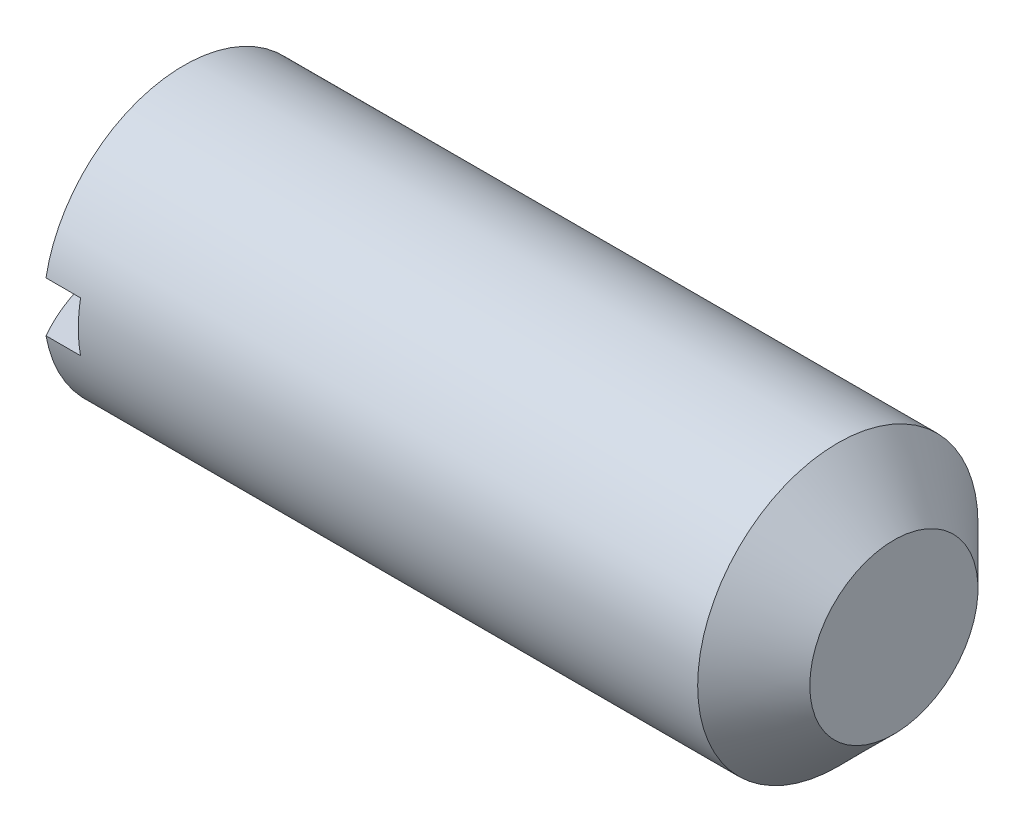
ISO-10303-21;
HEADER;
FILE_DESCRIPTION(('STEP AP214'),'2;1');
FILE_NAME('part.step','',(''),(''),'','','');
FILE_SCHEMA(('AUTOMOTIVE_DESIGN { 1 0 10303 214 1 1 1 1 }'));
ENDSEC;
DATA;
#1=APPLICATION_CONTEXT('core data for automotive mechanical design processes');
#2=APPLICATION_PROTOCOL_DEFINITION('international standard','automotive_design',2000,#1);
#3=PRODUCT_CONTEXT('',#1,'mechanical');
#4=PRODUCT('Part','Part','',(#3));
#5=PRODUCT_RELATED_PRODUCT_CATEGORY('part','',(#4));
#6=PRODUCT_DEFINITION_FORMATION('','',#4);
#7=PRODUCT_DEFINITION_CONTEXT('part definition',#1,'design');
#8=PRODUCT_DEFINITION('design','',#6,#7);
#9=PRODUCT_DEFINITION_SHAPE('','',#8);
#10=(LENGTH_UNIT() NAMED_UNIT(*) SI_UNIT(.MILLI.,.METRE.));
#11=(NAMED_UNIT(*) PLANE_ANGLE_UNIT() SI_UNIT($,.RADIAN.));
#12=(NAMED_UNIT(*) SI_UNIT($,.STERADIAN.) SOLID_ANGLE_UNIT());
#13=UNCERTAINTY_MEASURE_WITH_UNIT(LENGTH_MEASURE(1.E-05),#10,'distance_accuracy_value','');
#14=(GEOMETRIC_REPRESENTATION_CONTEXT(3) GLOBAL_UNCERTAINTY_ASSIGNED_CONTEXT((#13)) GLOBAL_UNIT_ASSIGNED_CONTEXT((#10,
#11,#12)) REPRESENTATION_CONTEXT('',''));
#15=CARTESIAN_POINT('',(0.,0.,0.));
#16=DIRECTION('',(0.,0.,1.));
#17=DIRECTION('',(1.,0.,0.));
#18=AXIS2_PLACEMENT_3D('',#15,#16,#17);
#19=CARTESIAN_POINT('',(19.05,0.,0.));
#20=DIRECTION('',(-1.,0.,0.));
#21=DIRECTION('',(0.,1.,0.));
#22=AXIS2_PLACEMENT_3D('',#19,#20,#21);
#23=SPHERICAL_SURFACE('',#22,19.05);
#24=CARTESIAN_POINT('',(19.05,1.7018,0.));
#25=DIRECTION('',(0.,-1.,0.));
#26=DIRECTION('',(0.,0.,-1.));
#27=AXIS2_PLACEMENT_3D('',#24,#25,#26);
#28=CIRCLE('',#27,18.9738340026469);
#29=CARTESIAN_POINT('',(2.55221605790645,1.7018,9.37173952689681));
#30=VERTEX_POINT('',#29);
#31=CARTESIAN_POINT('',(2.55221605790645,1.7018,-9.37173952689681));
#32=VERTEX_POINT('',#31);
#33=EDGE_CURVE('E103',#30,#32,#28,.T.);
#34=ORIENTED_EDGE('',*,*,#33,.F.);
#35=CARTESIAN_POINT('',(2.55221605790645,0.,0.));
#36=DIRECTION('',(-1.,0.,0.));
#37=DIRECTION('',(0.,0.,1.));
#38=AXIS2_PLACEMENT_3D('',#35,#36,#37);
#39=CIRCLE('',#38,9.525);
#40=EDGE_CURVE('E92',#30,#32,#39,.T.);
#41=ORIENTED_EDGE('',*,*,#40,.T.);
#42=EDGE_LOOP('',(#34,#41));
#43=FACE_BOUND('',#42,.T.);
#44=ADVANCED_FACE('F39',(#43),#23,.T.);
#45=CARTESIAN_POINT('',(19.05,-1.7018,0.));
#46=DIRECTION('',(0.,1.,0.));
#47=DIRECTION('',(0.,0.,1.));
#48=AXIS2_PLACEMENT_3D('',#45,#46,#47);
#49=CIRCLE('',#48,18.9738340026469);
#50=CARTESIAN_POINT('',(2.55221605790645,-1.7018,-9.37173952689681));
#51=VERTEX_POINT('',#50);
#52=CARTESIAN_POINT('',(2.55221605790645,-1.7018,9.37173952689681));
#53=VERTEX_POINT('',#52);
#54=EDGE_CURVE('E114',#51,#53,#49,.T.);
#55=ORIENTED_EDGE('',*,*,#54,.F.);
#56=EDGE_CURVE('E95',#51,#53,#39,.T.);
#57=ORIENTED_EDGE('',*,*,#56,.T.);
#58=EDGE_LOOP('',(#55,#57));
#59=FACE_BOUND('',#58,.T.);
#60=ADVANCED_FACE('F112',(#59),#23,.T.);
#61=CARTESIAN_POINT('',(-12.7,0.,0.));
#62=DIRECTION('',(-1.,0.,0.));
#63=DIRECTION('',(0.,0.,1.));
#64=AXIS2_PLACEMENT_3D('',#61,#62,#63);
#65=CYLINDRICAL_SURFACE('',#64,9.525);
#66=CARTESIAN_POINT('',(46.99,0.,0.));
#67=DIRECTION('',(-1.,0.,0.));
#68=DIRECTION('',(0.,0.,1.));
#69=AXIS2_PLACEMENT_3D('',#66,#67,#68);
#70=CIRCLE('',#69,9.525);
#71=CARTESIAN_POINT('',(46.99,0.,9.525));
#72=VERTEX_POINT('',#71);
#73=EDGE_CURVE('E93',#72,#72,#70,.T.);
#74=ORIENTED_EDGE('',*,*,#73,.T.);
#75=EDGE_LOOP('',(#74));
#76=FACE_BOUND('',#75,.T.);
#77=ORIENTED_EDGE('',*,*,#40,.F.);
#78=DIRECTION('',(-1.,0.,0.));
#79=VECTOR('',#78,1.);
#80=CARTESIAN_POINT('',(-12.7,1.7018,9.37173952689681));
#81=LINE('',#80,#79);
#82=CARTESIAN_POINT('',(4.9022,1.7018,9.37173952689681));
#83=VERTEX_POINT('',#82);
#84=EDGE_CURVE('E11',#30,#83,#81,.F.);
#85=ORIENTED_EDGE('',*,*,#84,.T.);
#86=CARTESIAN_POINT('',(4.9022,0.,0.));
#87=DIRECTION('',(1.,0.,0.));
#88=DIRECTION('',(0.,0.,-1.));
#89=AXIS2_PLACEMENT_3D('',#86,#87,#88);
#90=CIRCLE('',#89,9.525);
#91=CARTESIAN_POINT('',(4.9022,-1.7018,9.37173952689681));
#92=VERTEX_POINT('',#91);
#93=EDGE_CURVE('E75',#92,#83,#90,.F.);
#94=ORIENTED_EDGE('',*,*,#93,.F.);
#95=DIRECTION('',(-1.,0.,0.));
#96=VECTOR('',#95,1.);
#97=CARTESIAN_POINT('',(-12.7,-1.7018,9.37173952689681));
#98=LINE('',#97,#96);
#99=EDGE_CURVE('E46',#92,#53,#98,.T.);
#100=ORIENTED_EDGE('',*,*,#99,.T.);
#101=ORIENTED_EDGE('',*,*,#56,.F.);
#102=DIRECTION('',(-1.,0.,0.));
#103=VECTOR('',#102,1.);
#104=CARTESIAN_POINT('',(-12.7,-1.7018,-9.37173952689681));
#105=LINE('',#104,#103);
#106=CARTESIAN_POINT('',(4.9022,-1.7018,-9.37173952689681));
#107=VERTEX_POINT('',#106);
#108=EDGE_CURVE('E110',#51,#107,#105,.F.);
#109=ORIENTED_EDGE('',*,*,#108,.T.);
#110=CARTESIAN_POINT('',(4.9022,1.7018,-9.37173952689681));
#111=VERTEX_POINT('',#110);
#112=EDGE_CURVE('E83',#111,#107,#90,.F.);
#113=ORIENTED_EDGE('',*,*,#112,.F.);
#114=DIRECTION('',(-1.,0.,0.));
#115=VECTOR('',#114,1.);
#116=CARTESIAN_POINT('',(-12.7,1.7018,-9.37173952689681));
#117=LINE('',#116,#115);
#118=EDGE_CURVE('E81',#111,#32,#117,.T.);
#119=ORIENTED_EDGE('',*,*,#118,.T.);
#120=EDGE_LOOP('',(#77,#85,#94,#100,#101,#109,#113,#119));
#121=FACE_BOUND('',#120,.T.);
#122=ADVANCED_FACE('F89',(#76,#121),#65,.T.);
#123=CARTESIAN_POINT('',(50.8,0.,0.));
#124=DIRECTION('',(-1.,0.,0.));
#125=DIRECTION('',(0.,0.,1.));
#126=AXIS2_PLACEMENT_3D('',#123,#124,#125);
#127=PLANE('',#126);
#128=CARTESIAN_POINT('',(50.8,0.,0.));
#129=DIRECTION('',(-1.,0.,0.));
#130=DIRECTION('',(0.,0.,1.));
#131=AXIS2_PLACEMENT_3D('',#128,#129,#130);
#132=CIRCLE('',#131,5.715);
#133=CARTESIAN_POINT('',(50.8,0.,5.715));
#134=VERTEX_POINT('',#133);
#135=EDGE_CURVE('E96',#134,#134,#132,.T.);
#136=ORIENTED_EDGE('',*,*,#135,.F.);
#137=EDGE_LOOP('',(#136));
#138=FACE_BOUND('',#137,.T.);
#139=ADVANCED_FACE('F134',(#138),#127,.F.);
#140=CARTESIAN_POINT('',(50.8,0.,0.));
#141=DIRECTION('',(-1.,0.,0.));
#142=DIRECTION('',(0.,0.,1.));
#143=AXIS2_PLACEMENT_3D('',#140,#141,#142);
#144=CONICAL_SURFACE('',#143,5.715,0.785398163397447);
#145=ORIENTED_EDGE('',*,*,#73,.F.);
#146=EDGE_LOOP('',(#145));
#147=FACE_BOUND('',#146,.T.);
#148=ORIENTED_EDGE('',*,*,#135,.T.);
#149=EDGE_LOOP('',(#148));
#150=FACE_BOUND('',#149,.T.);
#151=ADVANCED_FACE('F123',(#147,#150),#144,.T.);
#152=CARTESIAN_POINT('',(4.9022,1.7018,-9.52499999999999));
#153=DIRECTION('',(0.,-1.,0.));
#154=DIRECTION('',(0.,0.,-1.));
#155=AXIS2_PLACEMENT_3D('',#152,#153,#154);
#156=PLANE('',#155);
#157=ORIENTED_EDGE('',*,*,#33,.T.);
#158=ORIENTED_EDGE('',*,*,#118,.F.);
#159=DIRECTION('',(0.,0.,1.));
#160=VECTOR('',#159,1.);
#161=CARTESIAN_POINT('',(4.9022,1.7018,-9.52499999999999));
#162=LINE('',#161,#160);
#163=EDGE_CURVE('E52',#111,#83,#162,.T.);
#164=ORIENTED_EDGE('',*,*,#163,.T.);
#165=ORIENTED_EDGE('',*,*,#84,.F.);
#166=EDGE_LOOP('',(#157,#158,#164,#165));
#167=FACE_BOUND('',#166,.T.);
#168=ADVANCED_FACE('F82',(#167),#156,.T.);
#169=CARTESIAN_POINT('',(4.9022,-1.7018,-9.52499999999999));
#170=DIRECTION('',(0.,1.,0.));
#171=DIRECTION('',(0.,0.,1.));
#172=AXIS2_PLACEMENT_3D('',#169,#170,#171);
#173=PLANE('',#172);
#174=ORIENTED_EDGE('',*,*,#54,.T.);
#175=ORIENTED_EDGE('',*,*,#99,.F.);
#176=DIRECTION('',(0.,0.,-1.));
#177=VECTOR('',#176,1.);
#178=CARTESIAN_POINT('',(4.9022,-1.7018,-9.52499999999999));
#179=LINE('',#178,#177);
#180=EDGE_CURVE('E76',#92,#107,#179,.T.);
#181=ORIENTED_EDGE('',*,*,#180,.T.);
#182=ORIENTED_EDGE('',*,*,#108,.F.);
#183=EDGE_LOOP('',(#174,#175,#181,#182));
#184=FACE_BOUND('',#183,.T.);
#185=ADVANCED_FACE('F120',(#184),#173,.T.);
#186=CARTESIAN_POINT('',(4.9022,1.7018,-9.52499999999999));
#187=DIRECTION('',(1.,0.,0.));
#188=DIRECTION('',(0.,0.,-1.));
#189=AXIS2_PLACEMENT_3D('',#186,#187,#188);
#190=PLANE('',#189);
#191=ORIENTED_EDGE('',*,*,#180,.F.);
#192=ORIENTED_EDGE('',*,*,#93,.T.);
#193=ORIENTED_EDGE('',*,*,#163,.F.);
#194=ORIENTED_EDGE('',*,*,#112,.T.);
#195=EDGE_LOOP('',(#191,#192,#193,#194));
#196=FACE_BOUND('',#195,.T.);
#197=ADVANCED_FACE('F77',(#196),#190,.F.);
#198=CLOSED_SHELL('',(#44,#60,#122,#139,#151,#168,#185,#197));
#199=MANIFOLD_SOLID_BREP('B2',#198);
#200=ADVANCED_BREP_SHAPE_REPRESENTATION('',(#18,#199),#14);
#201=SHAPE_DEFINITION_REPRESENTATION(#9,#200);
ENDSEC;
END-ISO-10303-21;
